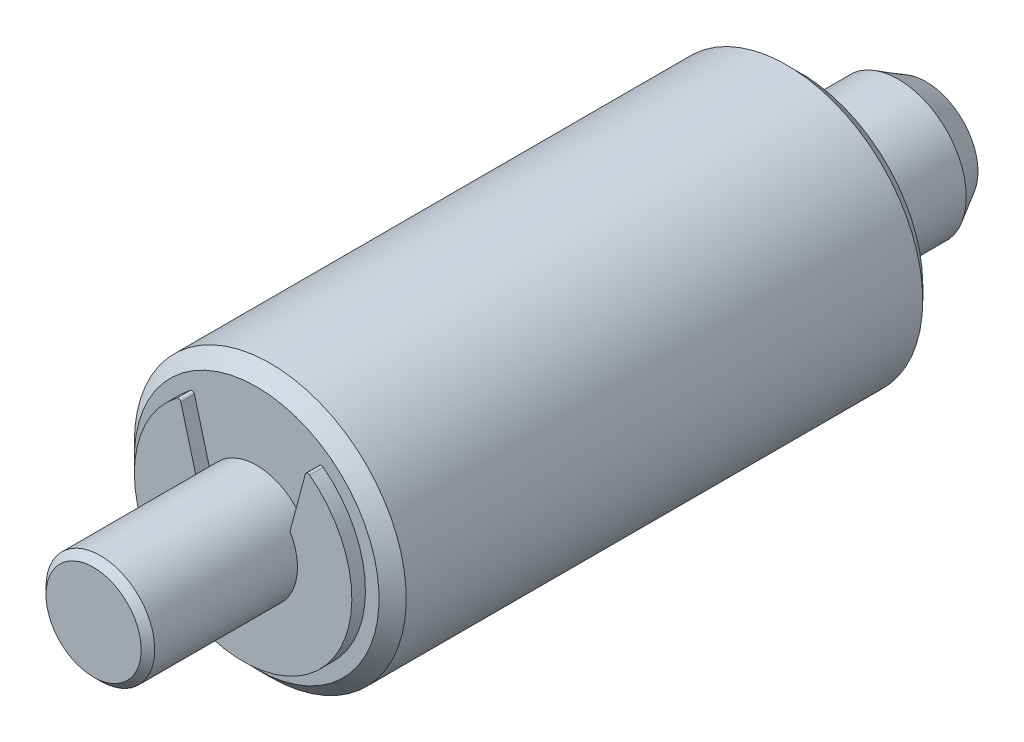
ISO-10303-21;
HEADER;
FILE_DESCRIPTION(('STEP AP214'),'2;1');
FILE_NAME('part.step','',(''),(''),'','','');
FILE_SCHEMA(('AUTOMOTIVE_DESIGN { 1 0 10303 214 1 1 1 1 }'));
ENDSEC;
DATA;
#1=APPLICATION_CONTEXT('core data for automotive mechanical design processes');
#2=APPLICATION_PROTOCOL_DEFINITION('international standard','automotive_design',2000,#1);
#3=PRODUCT_CONTEXT('',#1,'mechanical');
#4=PRODUCT('Part','Part','',(#3));
#5=PRODUCT_RELATED_PRODUCT_CATEGORY('part','',(#4));
#6=PRODUCT_DEFINITION_FORMATION('','',#4);
#7=PRODUCT_DEFINITION_CONTEXT('part definition',#1,'design');
#8=PRODUCT_DEFINITION('design','',#6,#7);
#9=PRODUCT_DEFINITION_SHAPE('','',#8);
#10=(LENGTH_UNIT() NAMED_UNIT(*) SI_UNIT(.MILLI.,.METRE.));
#11=(NAMED_UNIT(*) PLANE_ANGLE_UNIT() SI_UNIT($,.RADIAN.));
#12=(NAMED_UNIT(*) SI_UNIT($,.STERADIAN.) SOLID_ANGLE_UNIT());
#13=UNCERTAINTY_MEASURE_WITH_UNIT(LENGTH_MEASURE(1.E-05),#10,'distance_accuracy_value','');
#14=(GEOMETRIC_REPRESENTATION_CONTEXT(3) GLOBAL_UNCERTAINTY_ASSIGNED_CONTEXT((#13)) GLOBAL_UNIT_ASSIGNED_CONTEXT((#10,
#11,#12)) REPRESENTATION_CONTEXT('',''));
#15=CARTESIAN_POINT('',(0.,0.,0.));
#16=DIRECTION('',(0.,0.,1.));
#17=DIRECTION('',(1.,0.,0.));
#18=AXIS2_PLACEMENT_3D('',#15,#16,#17);
#19=CARTESIAN_POINT('',(9.108,-9.13934034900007,40.));
#20=DIRECTION('',(0.,0.,-1.));
#21=DIRECTION('',(-1.,0.,0.));
#22=AXIS2_PLACEMENT_3D('',#19,#20,#21);
#23=PLANE('',#22);
#24=CARTESIAN_POINT('',(0.,0.,40.));
#25=DIRECTION('',(0.,0.,-1.));
#26=DIRECTION('',(0.,-1.,0.));
#27=AXIS2_PLACEMENT_3D('',#24,#25,#26);
#28=CIRCLE('',#27,9.);
#29=CARTESIAN_POINT('',(0.,-9.00000000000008,40.));
#30=VERTEX_POINT('',#29);
#31=EDGE_CURVE('E156',#30,#30,#28,.T.);
#32=ORIENTED_EDGE('',*,*,#31,.F.);
#33=EDGE_LOOP('',(#32));
#34=FACE_BOUND('',#33,.T.);
#35=DIRECTION('',(-0.258819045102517,-0.965925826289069,0.));
#36=VECTOR('',#35,1.);
#37=CARTESIAN_POINT('',(3.45,2.02422824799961,40.));
#38=LINE('',#37,#36);
#39=CARTESIAN_POINT('',(4.57541189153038,6.22432260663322,40.));
#40=VERTEX_POINT('',#39);
#41=CARTESIAN_POINT('',(3.45,2.02422824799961,40.));
#42=VERTEX_POINT('',#41);
#43=EDGE_CURVE('E159',#40,#42,#38,.T.);
#44=ORIENTED_EDGE('',*,*,#43,.F.);
#45=CARTESIAN_POINT('',(4.76859705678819,6.17255879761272,40.));
#46=DIRECTION('',(0.,0.,1.));
#47=DIRECTION('',(1.,0.,0.));
#48=AXIS2_PLACEMENT_3D('',#45,#46,#47);
#49=CIRCLE('',#48,0.200000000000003);
#50=CARTESIAN_POINT('',(4.89086877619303,6.33082953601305,40.));
#51=VERTEX_POINT('',#50);
#52=EDGE_CURVE('E161',#51,#40,#49,.T.);
#53=ORIENTED_EDGE('',*,*,#52,.F.);
#54=CARTESIAN_POINT('',(0.,0.,40.));
#55=DIRECTION('',(0.,0.,1.));
#56=DIRECTION('',(1.,0.,0.));
#57=AXIS2_PLACEMENT_3D('',#54,#55,#56);
#58=CIRCLE('',#57,7.99999999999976);
#59=CARTESIAN_POINT('',(-4.89086877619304,6.33082953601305,40.));
#60=VERTEX_POINT('',#59);
#61=EDGE_CURVE('E165',#60,#51,#58,.T.);
#62=ORIENTED_EDGE('',*,*,#61,.F.);
#63=CARTESIAN_POINT('',(-4.76859705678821,6.17255879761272,40.));
#64=DIRECTION('',(0.,0.,1.));
#65=DIRECTION('',(1.,0.,0.));
#66=AXIS2_PLACEMENT_3D('',#63,#64,#65);
#67=CIRCLE('',#66,0.200000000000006);
#68=CARTESIAN_POINT('',(-4.57541189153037,6.22432260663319,40.));
#69=VERTEX_POINT('',#68);
#70=EDGE_CURVE('E65',#69,#60,#67,.T.);
#71=ORIENTED_EDGE('',*,*,#70,.F.);
#72=DIRECTION('',(-0.258819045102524,0.965925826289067,0.));
#73=VECTOR('',#72,1.);
#74=CARTESIAN_POINT('',(-3.45,2.02422824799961,40.));
#75=LINE('',#74,#73);
#76=CARTESIAN_POINT('',(-3.45,2.02422824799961,40.));
#77=VERTEX_POINT('',#76);
#78=EDGE_CURVE('E162',#77,#69,#75,.T.);
#79=ORIENTED_EDGE('',*,*,#78,.F.);
#80=CARTESIAN_POINT('',(0.,0.,40.));
#81=DIRECTION('',(0.,0.,-1.));
#82=DIRECTION('',(-1.,0.,0.));
#83=AXIS2_PLACEMENT_3D('',#80,#81,#82);
#84=CIRCLE('',#83,4.);
#85=EDGE_CURVE('E95',#42,#77,#84,.F.);
#86=ORIENTED_EDGE('',*,*,#85,.F.);
#87=EDGE_LOOP('',(#44,#53,#62,#71,#79,#86));
#88=FACE_BOUND('',#87,.T.);
#89=ADVANCED_FACE('F14',(#34,#88),#23,.F.);
#90=CARTESIAN_POINT('',(0.,0.,51.5));
#91=DIRECTION('',(0.,0.,-1.));
#92=DIRECTION('',(-1.,0.,0.));
#93=AXIS2_PLACEMENT_3D('',#90,#91,#92);
#94=CYLINDRICAL_SURFACE('',#93,4.);
#95=CARTESIAN_POINT('',(0.,0.,51.5));
#96=DIRECTION('',(0.,0.,-1.));
#97=DIRECTION('',(-1.,0.,0.));
#98=AXIS2_PLACEMENT_3D('',#95,#96,#97);
#99=CIRCLE('',#98,4.);
#100=CARTESIAN_POINT('',(-4.,0.,51.5));
#101=VERTEX_POINT('',#100);
#102=EDGE_CURVE('E9',#101,#101,#99,.F.);
#103=ORIENTED_EDGE('',*,*,#102,.F.);
#104=EDGE_LOOP('',(#103));
#105=FACE_BOUND('',#104,.T.);
#106=DIRECTION('',(0.,0.,-1.));
#107=VECTOR('',#106,1.);
#108=CARTESIAN_POINT('',(3.45,2.02422824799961,41.));
#109=LINE('',#108,#107);
#110=CARTESIAN_POINT('',(3.45,2.02422824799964,41.));
#111=VERTEX_POINT('',#110);
#112=EDGE_CURVE('E31',#111,#42,#109,.T.);
#113=ORIENTED_EDGE('',*,*,#112,.T.);
#114=ORIENTED_EDGE('',*,*,#85,.T.);
#115=DIRECTION('',(0.,0.,-1.));
#116=VECTOR('',#115,1.);
#117=CARTESIAN_POINT('',(-3.45,2.02422824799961,41.));
#118=LINE('',#117,#116);
#119=CARTESIAN_POINT('',(-3.45,2.02422824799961,41.));
#120=VERTEX_POINT('',#119);
#121=EDGE_CURVE('E88',#120,#77,#118,.T.);
#122=ORIENTED_EDGE('',*,*,#121,.F.);
#123=CARTESIAN_POINT('',(0.,0.,41.));
#124=DIRECTION('',(0.,0.,-1.));
#125=DIRECTION('',(1.,0.,0.));
#126=AXIS2_PLACEMENT_3D('',#123,#124,#125);
#127=CIRCLE('',#126,4.);
#128=EDGE_CURVE('E77',#111,#120,#127,.T.);
#129=ORIENTED_EDGE('',*,*,#128,.F.);
#130=EDGE_LOOP('',(#113,#114,#122,#129));
#131=FACE_BOUND('',#130,.T.);
#132=ADVANCED_FACE('F93',(#105,#131),#94,.T.);
#133=CARTESIAN_POINT('',(4.76120476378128E-10,3.4999780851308E-10,-8.26477775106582E-10));
#134=DIRECTION('',(-1.,0.,0.));
#135=DIRECTION('',(0.,0.,-1.));
#136=AXIS2_PLACEMENT_3D('',#133,#134,#135);
#137=SPHERICAL_SURFACE('',#136,10.);
#138=CARTESIAN_POINT('',(0.,0.,-9.240934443));
#139=DIRECTION('',(0.,0.,1.));
#140=DIRECTION('',(1.,0.,0.));
#141=AXIS2_PLACEMENT_3D('',#138,#139,#140);
#142=CIRCLE('',#141,3.82166595);
#143=CARTESIAN_POINT('',(3.82166595,0.,-9.240934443));
#144=VERTEX_POINT('',#143);
#145=EDGE_CURVE('E18',#144,#144,#142,.T.);
#146=ORIENTED_EDGE('',*,*,#145,.F.);
#147=EDGE_LOOP('',(#146));
#148=FACE_BOUND('',#147,.T.);
#149=ADVANCED_FACE('F110',(#148),#137,.T.);
#150=CARTESIAN_POINT('',(0.,0.,-9.240934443));
#151=DIRECTION('',(0.,0.,1.));
#152=DIRECTION('',(1.,0.,0.));
#153=AXIS2_PLACEMENT_3D('',#150,#151,#152);
#154=CONICAL_SURFACE('',#153,3.82166595,0.523598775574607);
#155=CARTESIAN_POINT('',(0.,0.,-7.2));
#156=DIRECTION('',(0.,0.,-1.));
#157=DIRECTION('',(-1.,0.,0.));
#158=AXIS2_PLACEMENT_3D('',#155,#156,#157);
#159=CIRCLE('',#158,5.);
#160=CARTESIAN_POINT('',(-5.,0.,-7.2));
#161=VERTEX_POINT('',#160);
#162=EDGE_CURVE('E302',#161,#161,#159,.F.);
#163=ORIENTED_EDGE('',*,*,#162,.F.);
#164=EDGE_LOOP('',(#163));
#165=FACE_BOUND('',#164,.T.);
#166=ORIENTED_EDGE('',*,*,#145,.T.);
#167=EDGE_LOOP('',(#166));
#168=FACE_BOUND('',#167,.T.);
#169=ADVANCED_FACE('F114',(#165,#168),#154,.T.);
#170=CARTESIAN_POINT('',(0.,0.,0.));
#171=DIRECTION('',(0.,0.,-1.));
#172=DIRECTION('',(-1.,0.,0.));
#173=AXIS2_PLACEMENT_3D('',#170,#171,#172);
#174=CYLINDRICAL_SURFACE('',#173,5.);
#175=ORIENTED_EDGE('',*,*,#162,.T.);
#176=EDGE_LOOP('',(#175));
#177=FACE_BOUND('',#176,.T.);
#178=CARTESIAN_POINT('',(0.,0.,0.));
#179=DIRECTION('',(0.,0.,-1.));
#180=DIRECTION('',(-1.,0.,0.));
#181=AXIS2_PLACEMENT_3D('',#178,#179,#180);
#182=CIRCLE('',#181,5.);
#183=CARTESIAN_POINT('',(-5.,0.,0.));
#184=VERTEX_POINT('',#183);
#185=EDGE_CURVE('E310',#184,#184,#182,.T.);
#186=ORIENTED_EDGE('',*,*,#185,.T.);
#187=EDGE_LOOP('',(#186));
#188=FACE_BOUND('',#187,.T.);
#189=ADVANCED_FACE('F120',(#177,#188),#174,.T.);
#190=CARTESIAN_POINT('',(-9.108,-9.13934034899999,0.));
#191=DIRECTION('',(0.,0.,1.));
#192=DIRECTION('',(1.,0.,0.));
#193=AXIS2_PLACEMENT_3D('',#190,#191,#192);
#194=PLANE('',#193);
#195=ORIENTED_EDGE('',*,*,#185,.F.);
#196=EDGE_LOOP('',(#195));
#197=FACE_BOUND('',#196,.T.);
#198=CARTESIAN_POINT('',(0.,0.,0.));
#199=DIRECTION('',(0.,0.,1.));
#200=DIRECTION('',(1.,0.,0.));
#201=AXIS2_PLACEMENT_3D('',#198,#199,#200);
#202=CIRCLE('',#201,9.);
#203=CARTESIAN_POINT('',(9.,0.,0.));
#204=VERTEX_POINT('',#203);
#205=EDGE_CURVE('E307',#204,#204,#202,.T.);
#206=ORIENTED_EDGE('',*,*,#205,.F.);
#207=EDGE_LOOP('',(#206));
#208=FACE_BOUND('',#207,.T.);
#209=ADVANCED_FACE('F124',(#197,#208),#194,.F.);
#210=CARTESIAN_POINT('',(0.,0.,0.));
#211=DIRECTION('',(0.,0.,1.));
#212=DIRECTION('',(1.,0.,0.));
#213=AXIS2_PLACEMENT_3D('',#210,#211,#212);
#214=CONICAL_SURFACE('',#213,9.,0.785398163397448);
#215=CARTESIAN_POINT('',(0.,0.,1.));
#216=DIRECTION('',(0.,0.,-1.));
#217=DIRECTION('',(-1.,0.,0.));
#218=AXIS2_PLACEMENT_3D('',#215,#216,#217);
#219=CIRCLE('',#218,10.);
#220=CARTESIAN_POINT('',(-10.,0.,1.));
#221=VERTEX_POINT('',#220);
#222=EDGE_CURVE('E309',#221,#221,#219,.F.);
#223=ORIENTED_EDGE('',*,*,#222,.F.);
#224=EDGE_LOOP('',(#223));
#225=FACE_BOUND('',#224,.T.);
#226=ORIENTED_EDGE('',*,*,#205,.T.);
#227=EDGE_LOOP('',(#226));
#228=FACE_BOUND('',#227,.T.);
#229=ADVANCED_FACE('F126',(#225,#228),#214,.T.);
#230=CARTESIAN_POINT('',(0.,0.,39.));
#231=DIRECTION('',(0.,0.,-1.));
#232=DIRECTION('',(0.,-1.,0.));
#233=AXIS2_PLACEMENT_3D('',#230,#231,#232);
#234=CYLINDRICAL_SURFACE('',#233,10.);
#235=ORIENTED_EDGE('',*,*,#222,.T.);
#236=EDGE_LOOP('',(#235));
#237=FACE_BOUND('',#236,.T.);
#238=CARTESIAN_POINT('',(0.,0.,39.));
#239=DIRECTION('',(0.,0.,-1.));
#240=DIRECTION('',(-1.,0.,0.));
#241=AXIS2_PLACEMENT_3D('',#238,#239,#240);
#242=CIRCLE('',#241,10.);
#243=CARTESIAN_POINT('',(-10.,0.,39.));
#244=VERTEX_POINT('',#243);
#245=EDGE_CURVE('E306',#244,#244,#242,.F.);
#246=ORIENTED_EDGE('',*,*,#245,.F.);
#247=EDGE_LOOP('',(#246));
#248=FACE_BOUND('',#247,.T.);
#249=ADVANCED_FACE('F129',(#237,#248),#234,.T.);
#250=CARTESIAN_POINT('',(0.,0.,40.));
#251=DIRECTION('',(0.,0.,-1.));
#252=DIRECTION('',(0.,-1.,0.));
#253=AXIS2_PLACEMENT_3D('',#250,#251,#252);
#254=CONICAL_SURFACE('',#253,9.,0.785398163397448);
#255=ORIENTED_EDGE('',*,*,#245,.T.);
#256=EDGE_LOOP('',(#255));
#257=FACE_BOUND('',#256,.T.);
#258=ORIENTED_EDGE('',*,*,#31,.T.);
#259=EDGE_LOOP('',(#258));
#260=FACE_BOUND('',#259,.T.);
#261=ADVANCED_FACE('F133',(#257,#260),#254,.T.);
#262=CARTESIAN_POINT('',(3.542,-3.55418791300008,52.));
#263=DIRECTION('',(0.,0.,-1.));
#264=DIRECTION('',(-1.,0.,0.));
#265=AXIS2_PLACEMENT_3D('',#262,#263,#264);
#266=PLANE('',#265);
#267=CARTESIAN_POINT('',(0.,0.,52.));
#268=DIRECTION('',(0.,0.,-1.));
#269=DIRECTION('',(0.,-1.,0.));
#270=AXIS2_PLACEMENT_3D('',#267,#268,#269);
#271=CIRCLE('',#270,3.49999999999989);
#272=CARTESIAN_POINT('',(0.,-3.49999999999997,52.));
#273=VERTEX_POINT('',#272);
#274=EDGE_CURVE('E23',#273,#273,#271,.T.);
#275=ORIENTED_EDGE('',*,*,#274,.F.);
#276=EDGE_LOOP('',(#275));
#277=FACE_BOUND('',#276,.T.);
#278=ADVANCED_FACE('F16',(#277),#266,.F.);
#279=CARTESIAN_POINT('',(0.,0.,52.));
#280=DIRECTION('',(0.,0.,-1.));
#281=DIRECTION('',(0.,-1.,0.));
#282=AXIS2_PLACEMENT_3D('',#279,#280,#281);
#283=CONICAL_SURFACE('',#282,3.5,0.785398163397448);
#284=ORIENTED_EDGE('',*,*,#102,.T.);
#285=EDGE_LOOP('',(#284));
#286=FACE_BOUND('',#285,.T.);
#287=ORIENTED_EDGE('',*,*,#274,.T.);
#288=EDGE_LOOP('',(#287));
#289=FACE_BOUND('',#288,.T.);
#290=ADVANCED_FACE('F141',(#286,#289),#283,.T.);
#291=CARTESIAN_POINT('',(0.,0.,41.));
#292=DIRECTION('',(0.,0.,-1.));
#293=DIRECTION('',(-1.,0.,0.));
#294=AXIS2_PLACEMENT_3D('',#291,#292,#293);
#295=CYLINDRICAL_SURFACE('',#294,7.99999999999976);
#296=ORIENTED_EDGE('',*,*,#61,.T.);
#297=DIRECTION('',(0.,0.,-1.));
#298=VECTOR('',#297,1.);
#299=CARTESIAN_POINT('',(4.89086877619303,6.33082953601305,41.));
#300=LINE('',#299,#298);
#301=CARTESIAN_POINT('',(4.89086877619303,6.33082953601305,41.));
#302=VERTEX_POINT('',#301);
#303=EDGE_CURVE('E105',#302,#51,#300,.T.);
#304=ORIENTED_EDGE('',*,*,#303,.F.);
#305=CARTESIAN_POINT('',(0.,0.,41.));
#306=DIRECTION('',(0.,0.,1.));
#307=DIRECTION('',(1.,0.,0.));
#308=AXIS2_PLACEMENT_3D('',#305,#306,#307);
#309=CIRCLE('',#308,7.99999999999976);
#310=CARTESIAN_POINT('',(-4.89086877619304,6.33082953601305,41.));
#311=VERTEX_POINT('',#310);
#312=EDGE_CURVE('E169',#311,#302,#309,.T.);
#313=ORIENTED_EDGE('',*,*,#312,.F.);
#314=DIRECTION('',(0.,0.,-1.));
#315=VECTOR('',#314,1.);
#316=CARTESIAN_POINT('',(-4.89086877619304,6.33082953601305,41.));
#317=LINE('',#316,#315);
#318=EDGE_CURVE('E99',#311,#60,#317,.T.);
#319=ORIENTED_EDGE('',*,*,#318,.T.);
#320=EDGE_LOOP('',(#296,#304,#313,#319));
#321=FACE_BOUND('',#320,.T.);
#322=ADVANCED_FACE('F116',(#321),#295,.T.);
#323=CARTESIAN_POINT('',(4.76859705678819,6.17255879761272,41.));
#324=DIRECTION('',(0.,0.,-1.));
#325=DIRECTION('',(-1.,0.,0.));
#326=AXIS2_PLACEMENT_3D('',#323,#324,#325);
#327=CYLINDRICAL_SURFACE('',#326,0.200000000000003);
#328=ORIENTED_EDGE('',*,*,#52,.T.);
#329=DIRECTION('',(0.,0.,-1.));
#330=VECTOR('',#329,1.);
#331=CARTESIAN_POINT('',(4.57541189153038,6.22432260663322,41.));
#332=LINE('',#331,#330);
#333=CARTESIAN_POINT('',(4.57541189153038,6.22432260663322,41.));
#334=VERTEX_POINT('',#333);
#335=EDGE_CURVE('E97',#334,#40,#332,.T.);
#336=ORIENTED_EDGE('',*,*,#335,.F.);
#337=CARTESIAN_POINT('',(4.76859705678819,6.17255879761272,41.));
#338=DIRECTION('',(0.,0.,1.));
#339=DIRECTION('',(1.,0.,0.));
#340=AXIS2_PLACEMENT_3D('',#337,#338,#339);
#341=CIRCLE('',#340,0.200000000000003);
#342=EDGE_CURVE('E73',#302,#334,#341,.T.);
#343=ORIENTED_EDGE('',*,*,#342,.F.);
#344=ORIENTED_EDGE('',*,*,#303,.T.);
#345=EDGE_LOOP('',(#328,#336,#343,#344));
#346=FACE_BOUND('',#345,.T.);
#347=ADVANCED_FACE('F179',(#346),#327,.T.);
#348=CARTESIAN_POINT('',(3.45,2.02422824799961,41.));
#349=DIRECTION('',(0.965925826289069,-0.258819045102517,0.));
#350=DIRECTION('',(0.258819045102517,0.965925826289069,0.));
#351=AXIS2_PLACEMENT_3D('',#348,#349,#350);
#352=PLANE('',#351);
#353=ORIENTED_EDGE('',*,*,#43,.T.);
#354=ORIENTED_EDGE('',*,*,#112,.F.);
#355=DIRECTION('',(-0.258819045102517,-0.965925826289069,0.));
#356=VECTOR('',#355,1.);
#357=CARTESIAN_POINT('',(3.45,2.02422824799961,41.));
#358=LINE('',#357,#356);
#359=EDGE_CURVE('E82',#334,#111,#358,.T.);
#360=ORIENTED_EDGE('',*,*,#359,.F.);
#361=ORIENTED_EDGE('',*,*,#335,.T.);
#362=EDGE_LOOP('',(#353,#354,#360,#361));
#363=FACE_BOUND('',#362,.T.);
#364=ADVANCED_FACE('F180',(#363),#352,.F.);
#365=CARTESIAN_POINT('',(-3.45,2.02422824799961,41.));
#366=DIRECTION('',(-0.965925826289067,-0.258819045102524,0.));
#367=DIRECTION('',(0.258819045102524,-0.965925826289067,0.));
#368=AXIS2_PLACEMENT_3D('',#365,#366,#367);
#369=PLANE('',#368);
#370=ORIENTED_EDGE('',*,*,#78,.T.);
#371=DIRECTION('',(0.,0.,-1.));
#372=VECTOR('',#371,1.);
#373=CARTESIAN_POINT('',(-4.57541189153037,6.22432260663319,41.));
#374=LINE('',#373,#372);
#375=CARTESIAN_POINT('',(-4.57541189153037,6.22432260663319,41.));
#376=VERTEX_POINT('',#375);
#377=EDGE_CURVE('E90',#376,#69,#374,.T.);
#378=ORIENTED_EDGE('',*,*,#377,.F.);
#379=DIRECTION('',(-0.258819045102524,0.965925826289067,0.));
#380=VECTOR('',#379,1.);
#381=CARTESIAN_POINT('',(-3.45,2.02422824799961,41.));
#382=LINE('',#381,#380);
#383=EDGE_CURVE('E80',#120,#376,#382,.T.);
#384=ORIENTED_EDGE('',*,*,#383,.F.);
#385=ORIENTED_EDGE('',*,*,#121,.T.);
#386=EDGE_LOOP('',(#370,#378,#384,#385));
#387=FACE_BOUND('',#386,.T.);
#388=ADVANCED_FACE('F87',(#387),#369,.F.);
#389=CARTESIAN_POINT('',(-4.76859705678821,6.17255879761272,41.));
#390=DIRECTION('',(0.,0.,-1.));
#391=DIRECTION('',(-1.,0.,0.));
#392=AXIS2_PLACEMENT_3D('',#389,#390,#391);
#393=CYLINDRICAL_SURFACE('',#392,0.200000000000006);
#394=ORIENTED_EDGE('',*,*,#70,.T.);
#395=ORIENTED_EDGE('',*,*,#318,.F.);
#396=CARTESIAN_POINT('',(-4.76859705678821,6.17255879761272,41.));
#397=DIRECTION('',(0.,0.,1.));
#398=DIRECTION('',(1.,0.,0.));
#399=AXIS2_PLACEMENT_3D('',#396,#397,#398);
#400=CIRCLE('',#399,0.200000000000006);
#401=EDGE_CURVE('E40',#376,#311,#400,.T.);
#402=ORIENTED_EDGE('',*,*,#401,.F.);
#403=ORIENTED_EDGE('',*,*,#377,.T.);
#404=EDGE_LOOP('',(#394,#395,#402,#403));
#405=FACE_BOUND('',#404,.T.);
#406=ADVANCED_FACE('F175',(#405),#393,.T.);
#407=CARTESIAN_POINT('',(0.,0.,41.));
#408=DIRECTION('',(0.,0.,1.));
#409=DIRECTION('',(1.,0.,0.));
#410=AXIS2_PLACEMENT_3D('',#407,#408,#409);
#411=PLANE('',#410);
#412=ORIENTED_EDGE('',*,*,#312,.T.);
#413=ORIENTED_EDGE('',*,*,#342,.T.);
#414=ORIENTED_EDGE('',*,*,#359,.T.);
#415=ORIENTED_EDGE('',*,*,#128,.T.);
#416=ORIENTED_EDGE('',*,*,#383,.T.);
#417=ORIENTED_EDGE('',*,*,#401,.T.);
#418=EDGE_LOOP('',(#412,#413,#414,#415,#416,#417));
#419=FACE_BOUND('',#418,.T.);
#420=ADVANCED_FACE('F79',(#419),#411,.T.);
#421=CLOSED_SHELL('',(#89,#132,#149,#169,#189,#209,#229,#249,#261,#278,#290,#322,#347,#364,#388,
#406,#420));
#422=MANIFOLD_SOLID_BREP('B1',#421);
#423=ADVANCED_BREP_SHAPE_REPRESENTATION('',(#18,#422),#14);
#424=SHAPE_DEFINITION_REPRESENTATION(#9,#423);
ENDSEC;
END-ISO-10303-21;
